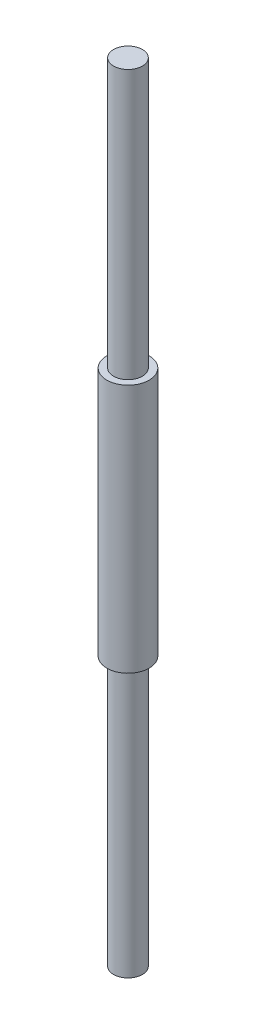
from build123d import *

# Parameters (mm, degrees)
SKETCH1_R           = 9.525
BOSS_EXTRUDE1_DEPTH = 177.8
SKETCH2_R           = 13.97
BOSS_EXTRUDE2_DEPTH = 165.1
SKETCH3_R           = 9.525
BOSS_EXTRUDE3_DEPTH = 177.8


with BuildPart() as part:
    # Sketch1 → Boss-Extrude1 (new body)
    with BuildSketch(Plane(origin=(0, 0, 0), x_dir=(1, 0, 0), z_dir=(0, 1, 0))):
        with Locations(Location((0, 0, 0), (0, 0, 270))):
            Circle(SKETCH1_R)
    extrude(amount=BOSS_EXTRUDE1_DEPTH)

    # Sketch2 → Boss-Extrude2 (add)
    with BuildSketch(Plane(origin=(0, 177.8, 0), x_dir=(1, 0, 0), z_dir=(0, 1, 0))):
        with Locations(Location((0, 0, 0), (0, 0, 270))):
            Circle(SKETCH2_R)
    extrude(amount=BOSS_EXTRUDE2_DEPTH)

    # Sketch3 → Boss-Extrude3 (add)
    with BuildSketch(Plane(origin=(0, 342.9, 0), x_dir=(1, 0, 0), z_dir=(0, 1, 0))):
        with Locations(Location((0, 0, 0), (0, 0, 270))):
            Circle(SKETCH3_R)
    extrude(amount=BOSS_EXTRUDE3_DEPTH)


solid = part.part
